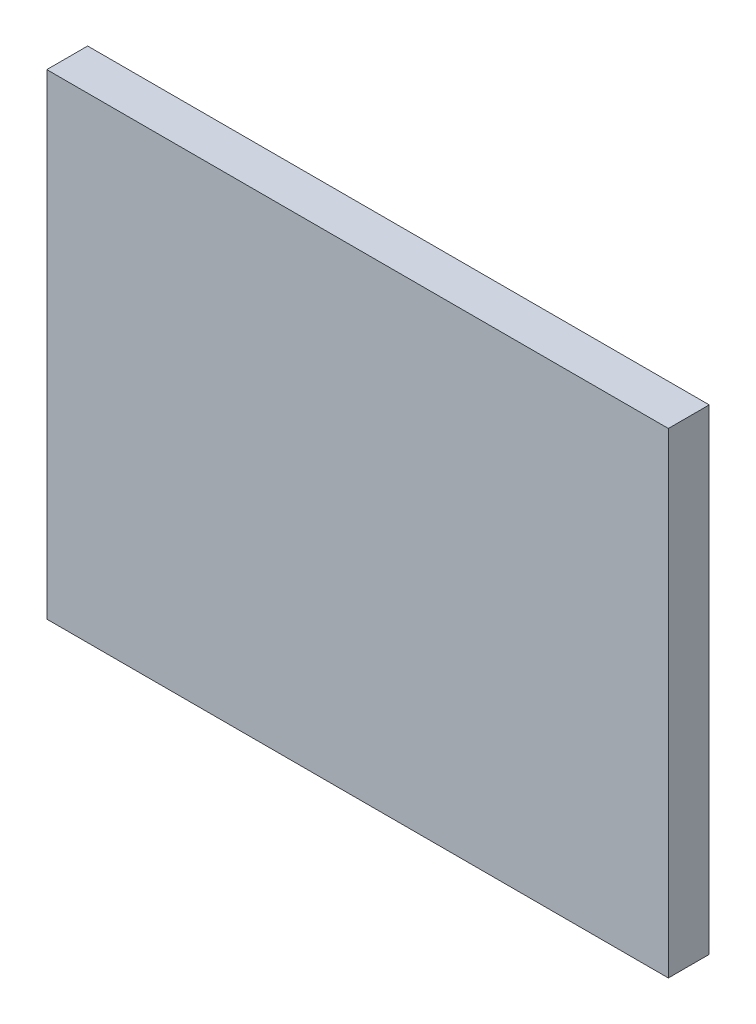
from build123d import *

# Parameters (mm, degrees)
SKETCH1_W      = 76.062657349
SKETCH1_H      = 58.237873
EXTRUDE1_DEPTH = 5


with BuildPart() as part:
    # Sketch1 → Extrude1 (new body)
    with BuildSketch(Plane.XY):
        with Locations((26.814007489, 4.148872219)):
            Rectangle(SKETCH1_W, SKETCH1_H)
    extrude(amount=EXTRUDE1_DEPTH)


solid = part.part
